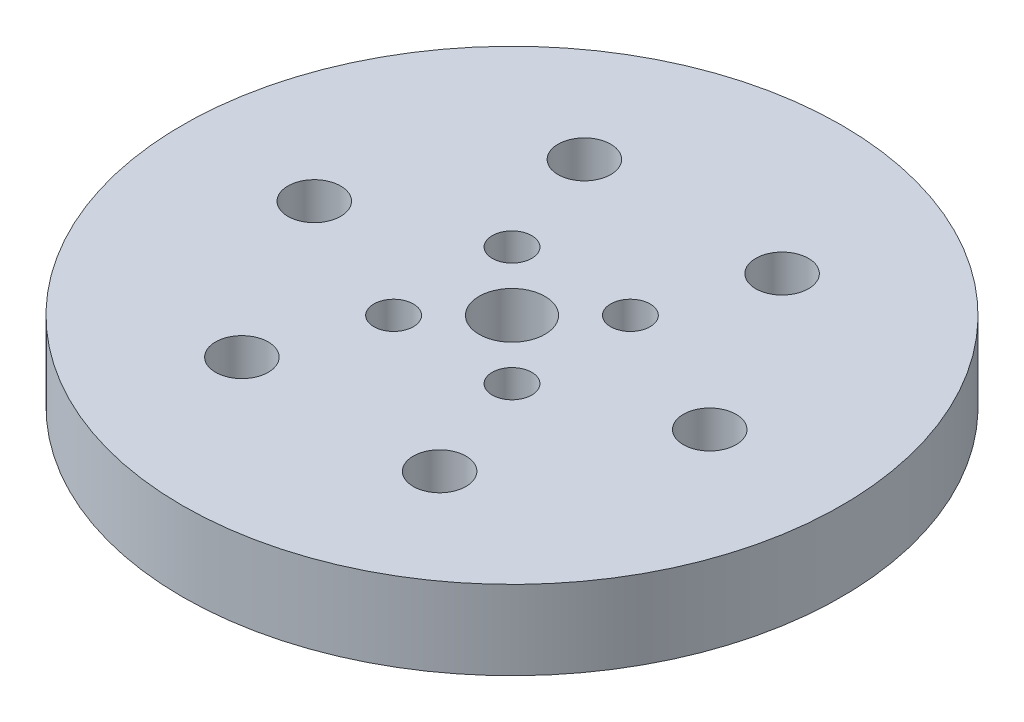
ISO-10303-21;
HEADER;
FILE_DESCRIPTION(('STEP AP214'),'2;1');
FILE_NAME('part.step','',(''),(''),'','','');
FILE_SCHEMA(('AUTOMOTIVE_DESIGN { 1 0 10303 214 1 1 1 1 }'));
ENDSEC;
DATA;
#1=APPLICATION_CONTEXT('core data for automotive mechanical design processes');
#2=APPLICATION_PROTOCOL_DEFINITION('international standard','automotive_design',2000,#1);
#3=PRODUCT_CONTEXT('',#1,'mechanical');
#4=PRODUCT('Part','Part','',(#3));
#5=PRODUCT_RELATED_PRODUCT_CATEGORY('part','',(#4));
#6=PRODUCT_DEFINITION_FORMATION('','',#4);
#7=PRODUCT_DEFINITION_CONTEXT('part definition',#1,'design');
#8=PRODUCT_DEFINITION('design','',#6,#7);
#9=PRODUCT_DEFINITION_SHAPE('','',#8);
#10=(LENGTH_UNIT() NAMED_UNIT(*) SI_UNIT(.MILLI.,.METRE.));
#11=(NAMED_UNIT(*) PLANE_ANGLE_UNIT() SI_UNIT($,.RADIAN.));
#12=(NAMED_UNIT(*) SI_UNIT($,.STERADIAN.) SOLID_ANGLE_UNIT());
#13=UNCERTAINTY_MEASURE_WITH_UNIT(LENGTH_MEASURE(1.E-05),#10,'distance_accuracy_value','');
#14=(GEOMETRIC_REPRESENTATION_CONTEXT(3) GLOBAL_UNCERTAINTY_ASSIGNED_CONTEXT((#13)) GLOBAL_UNIT_ASSIGNED_CONTEXT((#10,
#11,#12)) REPRESENTATION_CONTEXT('',''));
#15=CARTESIAN_POINT('',(0.,0.,0.));
#16=DIRECTION('',(0.,0.,1.));
#17=DIRECTION('',(1.,0.,0.));
#18=AXIS2_PLACEMENT_3D('',#15,#16,#17);
#19=CARTESIAN_POINT('',(0.,6.,0.));
#20=DIRECTION('',(0.,-1.,0.));
#21=DIRECTION('',(0.,0.,-1.));
#22=AXIS2_PLACEMENT_3D('',#19,#20,#21);
#23=CYLINDRICAL_SURFACE('',#22,25.);
#24=CARTESIAN_POINT('',(0.,6.,0.));
#25=DIRECTION('',(0.,1.,0.));
#26=DIRECTION('',(0.,0.,1.));
#27=AXIS2_PLACEMENT_3D('',#24,#25,#26);
#28=CIRCLE('',#27,25.);
#29=CARTESIAN_POINT('',(0.,6.,25.));
#30=VERTEX_POINT('',#29);
#31=EDGE_CURVE('E11',#30,#30,#28,.T.);
#32=ORIENTED_EDGE('',*,*,#31,.F.);
#33=EDGE_LOOP('',(#32));
#34=FACE_BOUND('',#33,.T.);
#35=CARTESIAN_POINT('',(0.,0.,0.));
#36=DIRECTION('',(0.,1.,0.));
#37=DIRECTION('',(0.,0.,1.));
#38=AXIS2_PLACEMENT_3D('',#35,#36,#37);
#39=CIRCLE('',#38,25.);
#40=CARTESIAN_POINT('',(0.,0.,25.));
#41=VERTEX_POINT('',#40);
#42=EDGE_CURVE('E40',#41,#41,#39,.T.);
#43=ORIENTED_EDGE('',*,*,#42,.T.);
#44=EDGE_LOOP('',(#43));
#45=FACE_BOUND('',#44,.T.);
#46=ADVANCED_FACE('F37',(#34,#45),#23,.T.);
#47=CARTESIAN_POINT('',(0.,6.,0.));
#48=DIRECTION('',(0.,1.,0.));
#49=DIRECTION('',(0.,0.,1.));
#50=AXIS2_PLACEMENT_3D('',#47,#48,#49);
#51=PLANE('',#50);
#52=CARTESIAN_POINT('',(-7.50000000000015,6.,12.9903810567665));
#53=DIRECTION('',(0.,1.,0.));
#54=DIRECTION('',(0.866025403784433,0.,0.50000000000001));
#55=AXIS2_PLACEMENT_3D('',#52,#53,#54);
#56=CIRCLE('',#55,2.);
#57=CARTESIAN_POINT('',(-5.76794919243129,6.,13.9903810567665));
#58=VERTEX_POINT('',#57);
#59=EDGE_CURVE('E141',#58,#58,#56,.T.);
#60=ORIENTED_EDGE('',*,*,#59,.F.);
#61=EDGE_LOOP('',(#60));
#62=FACE_BOUND('',#61,.T.);
#63=CARTESIAN_POINT('',(7.49999999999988,6.,12.9903810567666));
#64=DIRECTION('',(0.,1.,0.));
#65=DIRECTION('',(0.866025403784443,0.,-0.499999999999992));
#66=AXIS2_PLACEMENT_3D('',#63,#64,#65);
#67=CIRCLE('',#66,2.);
#68=CARTESIAN_POINT('',(9.23205080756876,6.,11.9903810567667));
#69=VERTEX_POINT('',#68);
#70=EDGE_CURVE('E134',#69,#69,#67,.T.);
#71=ORIENTED_EDGE('',*,*,#70,.F.);
#72=EDGE_LOOP('',(#71));
#73=FACE_BOUND('',#72,.T.);
#74=CARTESIAN_POINT('',(15.,6.,0.));
#75=DIRECTION('',(0.,1.,0.));
#76=DIRECTION('',(0.,0.,-1.));
#77=AXIS2_PLACEMENT_3D('',#74,#75,#76);
#78=CIRCLE('',#77,2.);
#79=CARTESIAN_POINT('',(15.,6.,-2.));
#80=VERTEX_POINT('',#79);
#81=EDGE_CURVE('E126',#80,#80,#78,.T.);
#82=ORIENTED_EDGE('',*,*,#81,.F.);
#83=EDGE_LOOP('',(#82));
#84=FACE_BOUND('',#83,.T.);
#85=CARTESIAN_POINT('',(7.50000000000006,6.,-12.9903810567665));
#86=DIRECTION('',(0.,1.,0.));
#87=DIRECTION('',(-0.866025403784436,0.,-0.500000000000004));
#88=AXIS2_PLACEMENT_3D('',#85,#86,#87);
#89=CIRCLE('',#88,2.);
#90=CARTESIAN_POINT('',(5.76794919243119,6.,-13.9903810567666));
#91=VERTEX_POINT('',#90);
#92=EDGE_CURVE('E118',#91,#91,#89,.T.);
#93=ORIENTED_EDGE('',*,*,#92,.F.);
#94=EDGE_LOOP('',(#93));
#95=FACE_BOUND('',#94,.T.);
#96=CARTESIAN_POINT('',(-7.49999999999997,6.,-12.9903810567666));
#97=DIRECTION('',(0.,1.,0.));
#98=DIRECTION('',(-0.86602540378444,0.,0.499999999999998));
#99=AXIS2_PLACEMENT_3D('',#96,#97,#98);
#100=CIRCLE('',#99,2.);
#101=CARTESIAN_POINT('',(-9.23205080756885,6.,-11.9903810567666));
#102=VERTEX_POINT('',#101);
#103=EDGE_CURVE('E105',#102,#102,#100,.T.);
#104=ORIENTED_EDGE('',*,*,#103,.F.);
#105=EDGE_LOOP('',(#104));
#106=FACE_BOUND('',#105,.T.);
#107=CARTESIAN_POINT('',(-15.,6.,0.));
#108=DIRECTION('',(0.,1.,0.));
#109=DIRECTION('',(0.,0.,1.));
#110=AXIS2_PLACEMENT_3D('',#107,#108,#109);
#111=CIRCLE('',#110,2.);
#112=CARTESIAN_POINT('',(-15.,6.,2.));
#113=VERTEX_POINT('',#112);
#114=EDGE_CURVE('E98',#113,#113,#111,.T.);
#115=ORIENTED_EDGE('',*,*,#114,.F.);
#116=EDGE_LOOP('',(#115));
#117=FACE_BOUND('',#116,.T.);
#118=CARTESIAN_POINT('',(-4.49012806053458,6.,4.49012806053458));
#119=DIRECTION('',(0.,1.,0.));
#120=DIRECTION('',(0.,0.,1.));
#121=AXIS2_PLACEMENT_3D('',#118,#119,#120);
#122=CIRCLE('',#121,1.5);
#123=CARTESIAN_POINT('',(-4.49012806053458,6.,5.99012806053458));
#124=VERTEX_POINT('',#123);
#125=EDGE_CURVE('E88',#124,#124,#122,.T.);
#126=ORIENTED_EDGE('',*,*,#125,.F.);
#127=EDGE_LOOP('',(#126));
#128=FACE_BOUND('',#127,.T.);
#129=CARTESIAN_POINT('',(4.49012806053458,6.,4.49012806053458));
#130=DIRECTION('',(0.,1.,0.));
#131=DIRECTION('',(0.,0.,1.));
#132=AXIS2_PLACEMENT_3D('',#129,#130,#131);
#133=CIRCLE('',#132,1.5);
#134=CARTESIAN_POINT('',(4.49012806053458,6.,5.99012806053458));
#135=VERTEX_POINT('',#134);
#136=EDGE_CURVE('E79',#135,#135,#133,.T.);
#137=ORIENTED_EDGE('',*,*,#136,.F.);
#138=EDGE_LOOP('',(#137));
#139=FACE_BOUND('',#138,.T.);
#140=CARTESIAN_POINT('',(4.49012806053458,6.,-4.49012806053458));
#141=DIRECTION('',(0.,1.,0.));
#142=DIRECTION('',(0.,0.,1.));
#143=AXIS2_PLACEMENT_3D('',#140,#141,#142);
#144=CIRCLE('',#143,1.5);
#145=CARTESIAN_POINT('',(4.49012806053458,6.,-2.99012806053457));
#146=VERTEX_POINT('',#145);
#147=EDGE_CURVE('E71',#146,#146,#144,.T.);
#148=ORIENTED_EDGE('',*,*,#147,.F.);
#149=EDGE_LOOP('',(#148));
#150=FACE_BOUND('',#149,.T.);
#151=CARTESIAN_POINT('',(-4.49012806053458,6.,-4.49012806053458));
#152=DIRECTION('',(0.,1.,0.));
#153=DIRECTION('',(0.,0.,1.));
#154=AXIS2_PLACEMENT_3D('',#151,#152,#153);
#155=CIRCLE('',#154,1.5);
#156=CARTESIAN_POINT('',(-4.49012806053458,6.,-2.99012806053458));
#157=VERTEX_POINT('',#156);
#158=EDGE_CURVE('E62',#157,#157,#155,.T.);
#159=ORIENTED_EDGE('',*,*,#158,.F.);
#160=EDGE_LOOP('',(#159));
#161=FACE_BOUND('',#160,.T.);
#162=CARTESIAN_POINT('',(0.,6.,0.));
#163=DIRECTION('',(0.,1.,0.));
#164=DIRECTION('',(0.,0.,1.));
#165=AXIS2_PLACEMENT_3D('',#162,#163,#164);
#166=CIRCLE('',#165,2.5);
#167=CARTESIAN_POINT('',(0.,6.,2.5));
#168=VERTEX_POINT('',#167);
#169=EDGE_CURVE('E51',#168,#168,#166,.T.);
#170=ORIENTED_EDGE('',*,*,#169,.F.);
#171=EDGE_LOOP('',(#170));
#172=FACE_BOUND('',#171,.T.);
#173=ORIENTED_EDGE('',*,*,#31,.T.);
#174=EDGE_LOOP('',(#173));
#175=FACE_BOUND('',#174,.T.);
#176=ADVANCED_FACE('F165',(#62,#73,#84,#95,#106,#117,#128,#139,#150,#161,#172,#175),#51,.T.);
#177=CARTESIAN_POINT('',(0.,0.,0.));
#178=DIRECTION('',(0.,1.,0.));
#179=DIRECTION('',(0.,0.,1.));
#180=AXIS2_PLACEMENT_3D('',#177,#178,#179);
#181=PLANE('',#180);
#182=CARTESIAN_POINT('',(-7.50000000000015,0.,12.9903810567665));
#183=DIRECTION('',(0.,1.,0.));
#184=DIRECTION('',(0.866025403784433,0.,0.50000000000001));
#185=AXIS2_PLACEMENT_3D('',#182,#183,#184);
#186=CIRCLE('',#185,2.);
#187=CARTESIAN_POINT('',(-5.76794919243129,0.,13.9903810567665));
#188=VERTEX_POINT('',#187);
#189=EDGE_CURVE('E139',#188,#188,#186,.T.);
#190=ORIENTED_EDGE('',*,*,#189,.T.);
#191=EDGE_LOOP('',(#190));
#192=FACE_BOUND('',#191,.T.);
#193=CARTESIAN_POINT('',(7.49999999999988,0.,12.9903810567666));
#194=DIRECTION('',(0.,1.,0.));
#195=DIRECTION('',(0.866025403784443,0.,-0.499999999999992));
#196=AXIS2_PLACEMENT_3D('',#193,#194,#195);
#197=CIRCLE('',#196,2.);
#198=CARTESIAN_POINT('',(9.23205080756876,0.,11.9903810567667));
#199=VERTEX_POINT('',#198);
#200=EDGE_CURVE('E131',#199,#199,#197,.T.);
#201=ORIENTED_EDGE('',*,*,#200,.T.);
#202=EDGE_LOOP('',(#201));
#203=FACE_BOUND('',#202,.T.);
#204=CARTESIAN_POINT('',(15.,0.,0.));
#205=DIRECTION('',(0.,1.,0.));
#206=DIRECTION('',(0.,0.,-1.));
#207=AXIS2_PLACEMENT_3D('',#204,#205,#206);
#208=CIRCLE('',#207,2.);
#209=CARTESIAN_POINT('',(15.,0.,-2.));
#210=VERTEX_POINT('',#209);
#211=EDGE_CURVE('E124',#210,#210,#208,.T.);
#212=ORIENTED_EDGE('',*,*,#211,.T.);
#213=EDGE_LOOP('',(#212));
#214=FACE_BOUND('',#213,.T.);
#215=CARTESIAN_POINT('',(7.50000000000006,0.,-12.9903810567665));
#216=DIRECTION('',(0.,1.,0.));
#217=DIRECTION('',(-0.866025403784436,0.,-0.500000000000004));
#218=AXIS2_PLACEMENT_3D('',#215,#216,#217);
#219=CIRCLE('',#218,2.);
#220=CARTESIAN_POINT('',(5.76794919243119,0.,-13.9903810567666));
#221=VERTEX_POINT('',#220);
#222=EDGE_CURVE('E111',#221,#221,#219,.T.);
#223=ORIENTED_EDGE('',*,*,#222,.T.);
#224=EDGE_LOOP('',(#223));
#225=FACE_BOUND('',#224,.T.);
#226=CARTESIAN_POINT('',(-7.49999999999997,0.,-12.9903810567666));
#227=DIRECTION('',(0.,1.,0.));
#228=DIRECTION('',(-0.86602540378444,0.,0.499999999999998));
#229=AXIS2_PLACEMENT_3D('',#226,#227,#228);
#230=CIRCLE('',#229,2.);
#231=CARTESIAN_POINT('',(-9.23205080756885,0.,-11.9903810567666));
#232=VERTEX_POINT('',#231);
#233=EDGE_CURVE('E103',#232,#232,#230,.T.);
#234=ORIENTED_EDGE('',*,*,#233,.T.);
#235=EDGE_LOOP('',(#234));
#236=FACE_BOUND('',#235,.T.);
#237=CARTESIAN_POINT('',(-15.,0.,0.));
#238=DIRECTION('',(0.,1.,0.));
#239=DIRECTION('',(0.,0.,1.));
#240=AXIS2_PLACEMENT_3D('',#237,#238,#239);
#241=CIRCLE('',#240,2.);
#242=CARTESIAN_POINT('',(-15.,0.,2.));
#243=VERTEX_POINT('',#242);
#244=EDGE_CURVE('E92',#243,#243,#241,.T.);
#245=ORIENTED_EDGE('',*,*,#244,.T.);
#246=EDGE_LOOP('',(#245));
#247=FACE_BOUND('',#246,.T.);
#248=CARTESIAN_POINT('',(-4.49012806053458,0.,4.49012806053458));
#249=DIRECTION('',(0.,1.,0.));
#250=DIRECTION('',(0.,0.,1.));
#251=AXIS2_PLACEMENT_3D('',#248,#249,#250);
#252=CIRCLE('',#251,1.5);
#253=CARTESIAN_POINT('',(-4.49012806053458,0.,5.99012806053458));
#254=VERTEX_POINT('',#253);
#255=EDGE_CURVE('E84',#254,#254,#252,.T.);
#256=ORIENTED_EDGE('',*,*,#255,.T.);
#257=EDGE_LOOP('',(#256));
#258=FACE_BOUND('',#257,.T.);
#259=CARTESIAN_POINT('',(4.49012806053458,0.,4.49012806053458));
#260=DIRECTION('',(0.,1.,0.));
#261=DIRECTION('',(0.,0.,1.));
#262=AXIS2_PLACEMENT_3D('',#259,#260,#261);
#263=CIRCLE('',#262,1.5);
#264=CARTESIAN_POINT('',(4.49012806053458,0.,5.99012806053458));
#265=VERTEX_POINT('',#264);
#266=EDGE_CURVE('E76',#265,#265,#263,.T.);
#267=ORIENTED_EDGE('',*,*,#266,.T.);
#268=EDGE_LOOP('',(#267));
#269=FACE_BOUND('',#268,.T.);
#270=CARTESIAN_POINT('',(4.49012806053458,0.,-4.49012806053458));
#271=DIRECTION('',(0.,1.,0.));
#272=DIRECTION('',(0.,0.,1.));
#273=AXIS2_PLACEMENT_3D('',#270,#271,#272);
#274=CIRCLE('',#273,1.5);
#275=CARTESIAN_POINT('',(4.49012806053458,0.,-2.99012806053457));
#276=VERTEX_POINT('',#275);
#277=EDGE_CURVE('E68',#276,#276,#274,.T.);
#278=ORIENTED_EDGE('',*,*,#277,.T.);
#279=EDGE_LOOP('',(#278));
#280=FACE_BOUND('',#279,.T.);
#281=CARTESIAN_POINT('',(-4.49012806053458,0.,-4.49012806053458));
#282=DIRECTION('',(0.,1.,0.));
#283=DIRECTION('',(0.,0.,1.));
#284=AXIS2_PLACEMENT_3D('',#281,#282,#283);
#285=CIRCLE('',#284,1.5);
#286=CARTESIAN_POINT('',(-4.49012806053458,0.,-2.99012806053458));
#287=VERTEX_POINT('',#286);
#288=EDGE_CURVE('E55',#287,#287,#285,.T.);
#289=ORIENTED_EDGE('',*,*,#288,.T.);
#290=EDGE_LOOP('',(#289));
#291=FACE_BOUND('',#290,.T.);
#292=CARTESIAN_POINT('',(0.,0.,0.));
#293=DIRECTION('',(0.,1.,0.));
#294=DIRECTION('',(0.,0.,1.));
#295=AXIS2_PLACEMENT_3D('',#292,#293,#294);
#296=CIRCLE('',#295,2.5);
#297=CARTESIAN_POINT('',(0.,0.,2.5));
#298=VERTEX_POINT('',#297);
#299=EDGE_CURVE('E48',#298,#298,#296,.T.);
#300=ORIENTED_EDGE('',*,*,#299,.T.);
#301=EDGE_LOOP('',(#300));
#302=FACE_BOUND('',#301,.T.);
#303=ORIENTED_EDGE('',*,*,#42,.F.);
#304=EDGE_LOOP('',(#303));
#305=FACE_BOUND('',#304,.T.);
#306=ADVANCED_FACE('F150',(#192,#203,#214,#225,#236,#247,#258,#269,#280,#291,#302,#305),#181,.F.);
#307=CARTESIAN_POINT('',(0.,0.,0.));
#308=DIRECTION('',(0.,1.,0.));
#309=DIRECTION('',(0.,0.,1.));
#310=AXIS2_PLACEMENT_3D('',#307,#308,#309);
#311=CYLINDRICAL_SURFACE('',#310,2.5);
#312=ORIENTED_EDGE('',*,*,#299,.F.);
#313=EDGE_LOOP('',(#312));
#314=FACE_BOUND('',#313,.T.);
#315=ORIENTED_EDGE('',*,*,#169,.T.);
#316=EDGE_LOOP('',(#315));
#317=FACE_BOUND('',#316,.T.);
#318=ADVANCED_FACE('F176',(#314,#317),#311,.F.);
#319=CARTESIAN_POINT('',(-4.49012806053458,0.,-4.49012806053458));
#320=DIRECTION('',(0.,1.,0.));
#321=DIRECTION('',(0.,0.,1.));
#322=AXIS2_PLACEMENT_3D('',#319,#320,#321);
#323=CYLINDRICAL_SURFACE('',#322,1.5);
#324=ORIENTED_EDGE('',*,*,#288,.F.);
#325=EDGE_LOOP('',(#324));
#326=FACE_BOUND('',#325,.T.);
#327=ORIENTED_EDGE('',*,*,#158,.T.);
#328=EDGE_LOOP('',(#327));
#329=FACE_BOUND('',#328,.T.);
#330=ADVANCED_FACE('F180',(#326,#329),#323,.F.);
#331=CARTESIAN_POINT('',(4.49012806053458,0.,-4.49012806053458));
#332=DIRECTION('',(0.,1.,0.));
#333=DIRECTION('',(0.,0.,1.));
#334=AXIS2_PLACEMENT_3D('',#331,#332,#333);
#335=CYLINDRICAL_SURFACE('',#334,1.5);
#336=ORIENTED_EDGE('',*,*,#277,.F.);
#337=EDGE_LOOP('',(#336));
#338=FACE_BOUND('',#337,.T.);
#339=ORIENTED_EDGE('',*,*,#147,.T.);
#340=EDGE_LOOP('',(#339));
#341=FACE_BOUND('',#340,.T.);
#342=ADVANCED_FACE('F192',(#338,#341),#335,.F.);
#343=CARTESIAN_POINT('',(4.49012806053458,0.,4.49012806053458));
#344=DIRECTION('',(0.,1.,0.));
#345=DIRECTION('',(0.,0.,1.));
#346=AXIS2_PLACEMENT_3D('',#343,#344,#345);
#347=CYLINDRICAL_SURFACE('',#346,1.5);
#348=ORIENTED_EDGE('',*,*,#266,.F.);
#349=EDGE_LOOP('',(#348));
#350=FACE_BOUND('',#349,.T.);
#351=ORIENTED_EDGE('',*,*,#136,.T.);
#352=EDGE_LOOP('',(#351));
#353=FACE_BOUND('',#352,.T.);
#354=ADVANCED_FACE('F188',(#350,#353),#347,.F.);
#355=CARTESIAN_POINT('',(-4.49012806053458,0.,4.49012806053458));
#356=DIRECTION('',(0.,1.,0.));
#357=DIRECTION('',(0.,0.,1.));
#358=AXIS2_PLACEMENT_3D('',#355,#356,#357);
#359=CYLINDRICAL_SURFACE('',#358,1.5);
#360=ORIENTED_EDGE('',*,*,#255,.F.);
#361=EDGE_LOOP('',(#360));
#362=FACE_BOUND('',#361,.T.);
#363=ORIENTED_EDGE('',*,*,#125,.T.);
#364=EDGE_LOOP('',(#363));
#365=FACE_BOUND('',#364,.T.);
#366=ADVANCED_FACE('F184',(#362,#365),#359,.F.);
#367=CARTESIAN_POINT('',(-15.,0.,0.));
#368=DIRECTION('',(0.,1.,0.));
#369=DIRECTION('',(0.,0.,1.));
#370=AXIS2_PLACEMENT_3D('',#367,#368,#369);
#371=CYLINDRICAL_SURFACE('',#370,2.);
#372=ORIENTED_EDGE('',*,*,#244,.F.);
#373=EDGE_LOOP('',(#372));
#374=FACE_BOUND('',#373,.T.);
#375=ORIENTED_EDGE('',*,*,#114,.T.);
#376=EDGE_LOOP('',(#375));
#377=FACE_BOUND('',#376,.T.);
#378=ADVANCED_FACE('F187',(#374,#377),#371,.F.);
#379=CARTESIAN_POINT('',(-7.49999999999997,0.,-12.9903810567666));
#380=DIRECTION('',(0.,1.,0.));
#381=DIRECTION('',(0.,0.,1.));
#382=AXIS2_PLACEMENT_3D('',#379,#380,#381);
#383=CYLINDRICAL_SURFACE('',#382,2.);
#384=ORIENTED_EDGE('',*,*,#233,.F.);
#385=EDGE_LOOP('',(#384));
#386=FACE_BOUND('',#385,.T.);
#387=ORIENTED_EDGE('',*,*,#103,.T.);
#388=EDGE_LOOP('',(#387));
#389=FACE_BOUND('',#388,.T.);
#390=ADVANCED_FACE('F201',(#386,#389),#383,.F.);
#391=CARTESIAN_POINT('',(7.50000000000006,0.,-12.9903810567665));
#392=DIRECTION('',(0.,1.,0.));
#393=DIRECTION('',(0.,0.,1.));
#394=AXIS2_PLACEMENT_3D('',#391,#392,#393);
#395=CYLINDRICAL_SURFACE('',#394,2.);
#396=ORIENTED_EDGE('',*,*,#222,.F.);
#397=EDGE_LOOP('',(#396));
#398=FACE_BOUND('',#397,.T.);
#399=ORIENTED_EDGE('',*,*,#92,.T.);
#400=EDGE_LOOP('',(#399));
#401=FACE_BOUND('',#400,.T.);
#402=ADVANCED_FACE('F204',(#398,#401),#395,.F.);
#403=CARTESIAN_POINT('',(15.,0.,0.));
#404=DIRECTION('',(0.,1.,0.));
#405=DIRECTION('',(0.,0.,1.));
#406=AXIS2_PLACEMENT_3D('',#403,#404,#405);
#407=CYLINDRICAL_SURFACE('',#406,2.);
#408=ORIENTED_EDGE('',*,*,#211,.F.);
#409=EDGE_LOOP('',(#408));
#410=FACE_BOUND('',#409,.T.);
#411=ORIENTED_EDGE('',*,*,#81,.T.);
#412=EDGE_LOOP('',(#411));
#413=FACE_BOUND('',#412,.T.);
#414=ADVANCED_FACE('F160',(#410,#413),#407,.F.);
#415=CARTESIAN_POINT('',(7.49999999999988,0.,12.9903810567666));
#416=DIRECTION('',(0.,1.,0.));
#417=DIRECTION('',(0.,0.,1.));
#418=AXIS2_PLACEMENT_3D('',#415,#416,#417);
#419=CYLINDRICAL_SURFACE('',#418,2.);
#420=ORIENTED_EDGE('',*,*,#200,.F.);
#421=EDGE_LOOP('',(#420));
#422=FACE_BOUND('',#421,.T.);
#423=ORIENTED_EDGE('',*,*,#70,.T.);
#424=EDGE_LOOP('',(#423));
#425=FACE_BOUND('',#424,.T.);
#426=ADVANCED_FACE('F155',(#422,#425),#419,.F.);
#427=CARTESIAN_POINT('',(-7.50000000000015,0.,12.9903810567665));
#428=DIRECTION('',(0.,1.,0.));
#429=DIRECTION('',(0.,0.,1.));
#430=AXIS2_PLACEMENT_3D('',#427,#428,#429);
#431=CYLINDRICAL_SURFACE('',#430,2.);
#432=ORIENTED_EDGE('',*,*,#189,.F.);
#433=EDGE_LOOP('',(#432));
#434=FACE_BOUND('',#433,.T.);
#435=ORIENTED_EDGE('',*,*,#59,.T.);
#436=EDGE_LOOP('',(#435));
#437=FACE_BOUND('',#436,.T.);
#438=ADVANCED_FACE('F153',(#434,#437),#431,.F.);
#439=CLOSED_SHELL('',(#46,#176,#306,#318,#330,#342,#354,#366,#378,#390,#402,#414,#426,#438));
#440=MANIFOLD_SOLID_BREP('B2',#439);
#441=ADVANCED_BREP_SHAPE_REPRESENTATION('',(#18,#440),#14);
#442=SHAPE_DEFINITION_REPRESENTATION(#9,#441);
ENDSEC;
END-ISO-10303-21;
